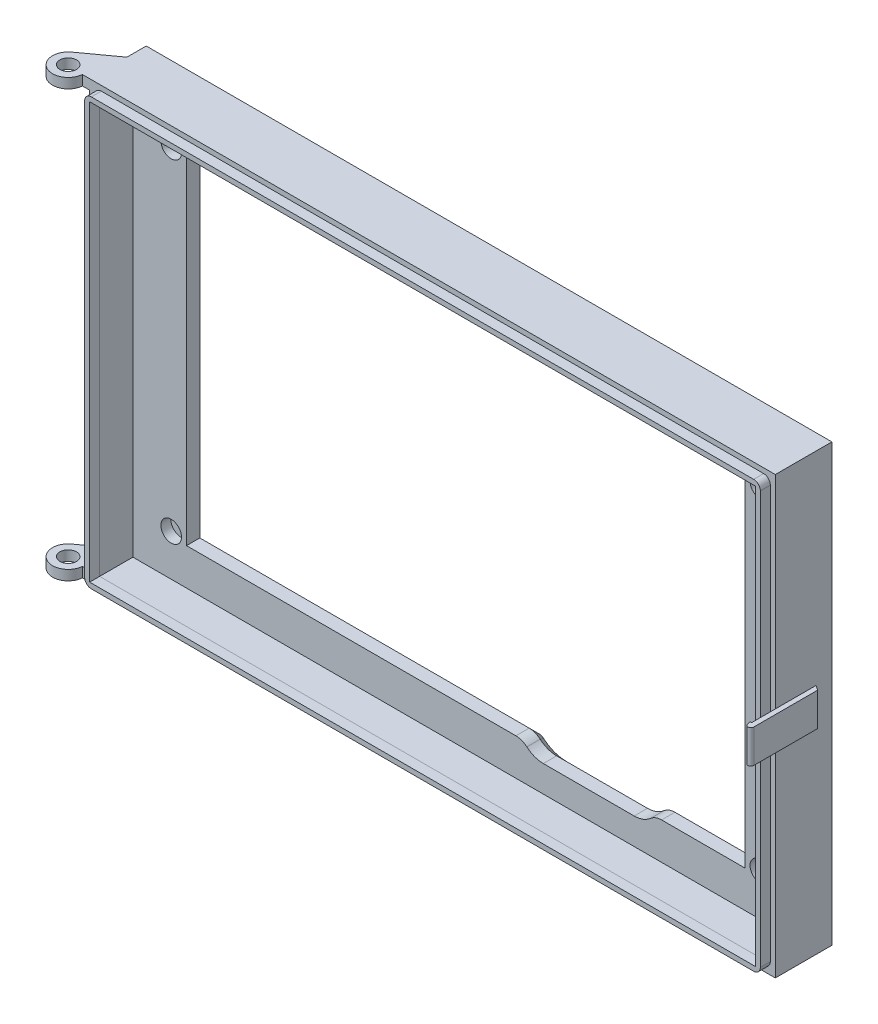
from build123d import *

# Parameters (mm, degrees)
SKETCH1_W           = 206
SKETCH1_H           = 131
BOSS_EXTRUDE1_DEPTH = 7
CUT_EXTRUDE1_DEPTH  = 7
SKETCH3_R           = 3.1
CUT_EXTRUDE3_DEPTH  = 3
SKETCH4_W           = 206
SKETCH4_H           = 131
SKETCH4_W_2         = 200
SKETCH4_H_2         = 125
BOSS_EXTRUDE2_DEPTH = 10
FILLET1_R           = 5
CHAMFER1_SIZE       = 3
BOSS_EXTRUDE3_START = 17
SKETCH5_W           = 203
SKETCH5_H           = 128
SKETCH5_W_2         = 200
SKETCH5_H_2         = 125
BOSS_EXTRUDE3_DEPTH = 3
FILLET2_R           = 2
SKETCH7_R           = 2.5
BOSS_EXTRUDE5_DEPTH = 3
BOSS_EXTRUDE6_START = 60
BOSS_EXTRUDE6_DEPTH = 10
BOSS_EXTRUDE7_START = 3
SKETCH6_R           = 2.5
BOSS_EXTRUDE7_DEPTH = 3


with BuildPart() as part:
    # Sketch1 → Boss-Extrude1 (new body)
    with BuildSketch(Plane.XY):
        with Locations((18.789473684, 65.5)):
            Rectangle(SKETCH1_W, SKETCH1_H)
    extrude(amount=BOSS_EXTRUDE1_DEPTH)

    # Sketch2 → Cut-Extrude1 (cut)
    with BuildSketch(Plane.XY.offset(7)):
        with BuildLine():
            Line((-65.110526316, 116.95), (102.689473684, 116.95))
            Line((102.689473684, 116.95), (102.689473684, 14.05))
            Line((102.689473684, 14.05), (75.46318754, 14.05))
            ThreePointArc((75.46318754, 14.05), (72.799019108, 11.769805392), (69.389473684, 10.95))
            Line((69.389473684, 10.95), (42.089473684, 10.95))
            ThreePointArc((42.089473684, 10.95), (38.67992826, 11.769805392), (36.015759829, 14.05))
            Line((36.015759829, 14.05), (-65.110526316, 14.05))
            Line((-65.110526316, 14.05), (-65.110526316, 116.95))
        make_face()
    extrude(amount=-CUT_EXTRUDE1_DEPTH, mode=Mode.SUBTRACT)

    # Sketch3 → Cut-Extrude3 (cut)
    with BuildSketch(Plane.XY.offset(7)):
        with Locations((-69.710526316, 115.5)):
            Circle(SKETCH3_R)
        with Locations((-69.710526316, 15.5)):
            Circle(SKETCH3_R)
        with Locations((107.289473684, 15.5)):
            Circle(SKETCH3_R)
        with Locations((107.289473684, 115.5)):
            Circle(SKETCH3_R)
    extrude(amount=-CUT_EXTRUDE3_DEPTH, mode=Mode.SUBTRACT)

    # Sketch4 → Boss-Extrude2 (add)
    with BuildSketch(Plane.XY.offset(7)):
        with Locations((18.789473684, 65.5)):
            Rectangle(SKETCH4_W, SKETCH4_H)
        with Locations((18.789473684, 65.5)):
            Rectangle(SKETCH4_W_2, SKETCH4_H_2, mode=Mode.SUBTRACT)
    extrude(amount=BOSS_EXTRUDE2_DEPTH)

    # Fillet1
    fillet1_edges = [part.edges().sort_by_distance(p)[0] for p in [
        (36.015759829, 14.05, 3.5),
        (75.46318754, 14.05, 3.5),
    ]]
    fillet(fillet1_edges, radius=FILLET1_R)

    # Chamfer1
    chamfer1_edges = [part.edges().sort_by_distance(p)[0] for p in [
        (-15.630295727, 14.05, 0),
        (55.739473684, 10.95, 0),
        (72.030496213, 11.430384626, 0),
        (102.689473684, 65.5, 0),
        (18.789473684, 116.95, 0),
        (-65.110526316, 65.5, 0),
        (39.448451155, 11.430384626, 0),
        (90.159243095, 14.05, 0),
        (75.86833082, 13.729743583, 0),
        (35.610616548, 13.729743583, 0),
    ]]
    chamfer(chamfer1_edges, length=CHAMFER1_SIZE)

    # Sketch7 → Boss-Extrude5 (add)
    with BuildSketch(Plane(origin=(0, 131, 0), x_dir=(1, 0, 0), z_dir=(0, 1, 0))):
        with BuildLine():
            Line((-86.390606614, -17), (-84.210526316, -17))
            Line((-84.210526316, -17), (-84.210526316, -5.806391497))
            Line((-84.210526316, -5.806391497), (-93.671368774, -12.670239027))
            ThreePointArc((-93.671368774, -12.670239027), (-93.47468424, -20.625909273), (-86.390606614, -17))
        make_face()
        with Locations(Location((-91.072359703, -16.586251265, 0), (0, 0, 270))):
            Circle(SKETCH7_R, mode=Mode.SUBTRACT)
    extrude(amount=-BOSS_EXTRUDE5_DEPTH)

    # Sketch8 → Boss-Extrude6 (add)
    with BuildSketch(Plane(origin=(0, 0, 0), x_dir=(1, 0, 0), z_dir=(0, 1, 0)).offset(BOSS_EXTRUDE6_START)):
        with BuildLine():
            Line((121.789473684, -4.735783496), (123.251845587, -5.743517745))
            Line((123.251845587, -5.743517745), (123.247592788, -24.917761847))
            ThreePointArc((123.247592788, -24.917761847), (122.6185145, -25.759077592), (121.633480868, -25.394029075))
            Line((121.633480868, -25.394029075), (121.302021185, -24.270682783))
            Line((121.302021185, -24.270682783), (121.302172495, -24.135260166))
            Line((121.302172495, -24.135260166), (121.789473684, -24.135260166))
            Line((121.789473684, -24.135260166), (121.789473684, -17))
            Line((121.789473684, -17), (121.789473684, -4.735783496))
        make_face()
    extrude(amount=BOSS_EXTRUDE6_DEPTH)

    # Sketch6 → Boss-Extrude7 (add)
    with BuildSketch(Plane(origin=(0, 0, 0), x_dir=(1, 0, 0), z_dir=(0, 1, 0)).offset(BOSS_EXTRUDE7_START)):
        with BuildLine():
            Line((-84.210526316, -17), (-86.390606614, -17))
            ThreePointArc((-86.390606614, -17), (-93.47468424, -20.625909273), (-93.671368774, -12.670239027))
            Line((-93.671368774, -12.670239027), (-84.210526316, -5.806391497))
            Line((-84.210526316, -5.806391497), (-84.210526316, -17))
        make_face()
        with Locations(Location((-91.072359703, -16.586251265, 0), (0, 0, 270))):
            Circle(SKETCH6_R, mode=Mode.SUBTRACT)
    extrude(amount=-BOSS_EXTRUDE7_DEPTH)


with BuildPart() as body_2:
    # Sketch5 → Boss-Extrude3 (new body)
    with BuildSketch(Plane.XY.offset(BOSS_EXTRUDE3_START)):
        with Locations((18.789473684, 65.5)):
            Rectangle(SKETCH5_W, SKETCH5_H)
        with Locations((18.789473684, 65.5)):
            Rectangle(SKETCH5_W_2, SKETCH5_H_2, mode=Mode.SUBTRACT)
    extrude(amount=BOSS_EXTRUDE3_DEPTH)

    # Fillet2
    fillet2_edges = [body_2.edges().sort_by_distance(p)[0] for p in [
        (120.289473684, 1.5, 18.5),
        (120.289473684, 129.5, 18.5),
        (-82.710526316, 129.5, 18.5),
        (-82.710526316, 1.5, 18.5),
    ]]
    fillet(fillet2_edges, radius=FILLET2_R)


solid = Compound([part.part, body_2.part])
